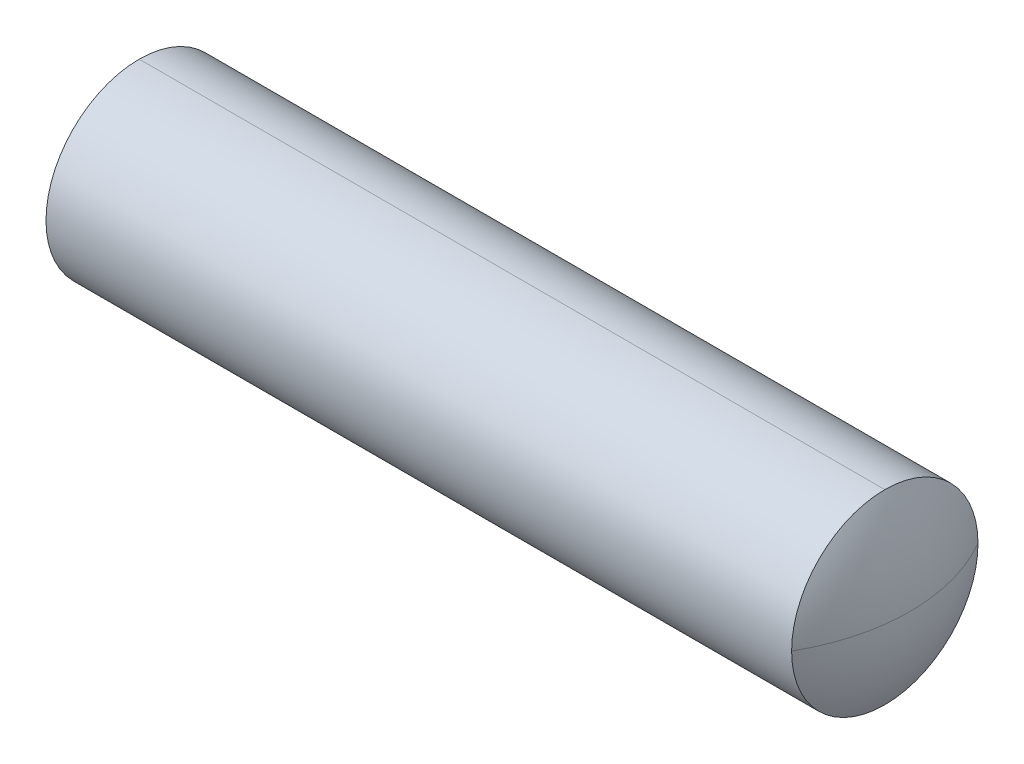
ISO-10303-21;
HEADER;
FILE_DESCRIPTION(('STEP AP214'),'2;1');
FILE_NAME('part.step','',(''),(''),'','','');
FILE_SCHEMA(('AUTOMOTIVE_DESIGN { 1 0 10303 214 1 1 1 1 }'));
ENDSEC;
DATA;
#1=APPLICATION_CONTEXT('core data for automotive mechanical design processes');
#2=APPLICATION_PROTOCOL_DEFINITION('international standard','automotive_design',2000,#1);
#3=PRODUCT_CONTEXT('',#1,'mechanical');
#4=PRODUCT('Part','Part','',(#3));
#5=PRODUCT_RELATED_PRODUCT_CATEGORY('part','',(#4));
#6=PRODUCT_DEFINITION_FORMATION('','',#4);
#7=PRODUCT_DEFINITION_CONTEXT('part definition',#1,'design');
#8=PRODUCT_DEFINITION('design','',#6,#7);
#9=PRODUCT_DEFINITION_SHAPE('','',#8);
#10=(LENGTH_UNIT() NAMED_UNIT(*) SI_UNIT(.MILLI.,.METRE.));
#11=(NAMED_UNIT(*) PLANE_ANGLE_UNIT() SI_UNIT($,.RADIAN.));
#12=(NAMED_UNIT(*) SI_UNIT($,.STERADIAN.) SOLID_ANGLE_UNIT());
#13=UNCERTAINTY_MEASURE_WITH_UNIT(LENGTH_MEASURE(1.E-05),#10,'distance_accuracy_value','');
#14=(GEOMETRIC_REPRESENTATION_CONTEXT(3) GLOBAL_UNCERTAINTY_ASSIGNED_CONTEXT((#13)) GLOBAL_UNIT_ASSIGNED_CONTEXT((#10,
#11,#12)) REPRESENTATION_CONTEXT('',''));
#15=CARTESIAN_POINT('',(0.,0.,0.));
#16=DIRECTION('',(0.,0.,1.));
#17=DIRECTION('',(1.,0.,0.));
#18=AXIS2_PLACEMENT_3D('',#15,#16,#17);
#19=CARTESIAN_POINT('',(4.330127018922,0.,0.));
#20=DIRECTION('',(0.,1.,0.));
#21=DIRECTION('',(1.,0.,0.));
#22=AXIS2_PLACEMENT_3D('',#19,#20,#21);
#23=SPHERICAL_SURFACE('',#22,5.);
#24=CARTESIAN_POINT('',(0.,0.,0.));
#25=DIRECTION('',(-1.,0.,0.));
#26=DIRECTION('',(0.,0.,1.));
#27=AXIS2_PLACEMENT_3D('',#24,#25,#26);
#28=CIRCLE('',#27,2.5);
#29=CARTESIAN_POINT('',(0.,0.,2.5));
#30=VERTEX_POINT('',#29);
#31=CARTESIAN_POINT('',(0.,2.5,0.));
#32=VERTEX_POINT('',#31);
#33=EDGE_CURVE('E102',#30,#32,#28,.T.);
#34=ORIENTED_EDGE('',*,*,#33,.T.);
#35=CARTESIAN_POINT('',(0.,0.,0.));
#36=DIRECTION('',(-1.,0.,0.));
#37=DIRECTION('',(0.,1.,0.));
#38=AXIS2_PLACEMENT_3D('',#35,#36,#37);
#39=CIRCLE('',#38,2.5);
#40=CARTESIAN_POINT('',(0.,0.,-2.5));
#41=VERTEX_POINT('',#40);
#42=EDGE_CURVE('E109',#32,#41,#39,.T.);
#43=ORIENTED_EDGE('',*,*,#42,.T.);
#44=CARTESIAN_POINT('',(4.330127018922,0.,0.));
#45=DIRECTION('',(0.,1.,0.));
#46=DIRECTION('',(-0.866025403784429,0.,-0.500000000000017));
#47=AXIS2_PLACEMENT_3D('',#44,#45,#46);
#48=CIRCLE('',#47,5.);
#49=EDGE_CURVE('E11',#41,#30,#48,.T.);
#50=ORIENTED_EDGE('',*,*,#49,.T.);
#51=EDGE_LOOP('',(#34,#43,#50));
#52=FACE_BOUND('',#51,.T.);
#53=ADVANCED_FACE('F17',(#52),#23,.T.);
#54=CARTESIAN_POINT('',(4.330127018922,0.,0.));
#55=DIRECTION('',(0.,1.,0.));
#56=DIRECTION('',(-0.500000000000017,0.,0.866025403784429));
#57=AXIS2_PLACEMENT_3D('',#54,#55,#56);
#58=SPHERICAL_SURFACE('',#57,5.);
#59=CARTESIAN_POINT('',(0.,0.,0.));
#60=DIRECTION('',(-1.,0.,0.));
#61=DIRECTION('',(0.,0.,-1.));
#62=AXIS2_PLACEMENT_3D('',#59,#60,#61);
#63=CIRCLE('',#62,2.5);
#64=CARTESIAN_POINT('',(0.,-2.5,0.));
#65=VERTEX_POINT('',#64);
#66=EDGE_CURVE('E105',#41,#65,#63,.T.);
#67=ORIENTED_EDGE('',*,*,#66,.T.);
#68=CARTESIAN_POINT('',(0.,0.,0.));
#69=DIRECTION('',(-1.,0.,0.));
#70=DIRECTION('',(0.,-1.,0.));
#71=AXIS2_PLACEMENT_3D('',#68,#69,#70);
#72=CIRCLE('',#71,2.5);
#73=EDGE_CURVE('E26',#65,#30,#72,.T.);
#74=ORIENTED_EDGE('',*,*,#73,.T.);
#75=ORIENTED_EDGE('',*,*,#49,.F.);
#76=EDGE_LOOP('',(#67,#74,#75));
#77=FACE_BOUND('',#76,.T.);
#78=ADVANCED_FACE('F121',(#77),#58,.T.);
#79=CARTESIAN_POINT('',(10.,0.,0.));
#80=DIRECTION('',(-1.,0.,0.));
#81=DIRECTION('',(0.,1.,0.));
#82=AXIS2_PLACEMENT_3D('',#79,#80,#81);
#83=CYLINDRICAL_SURFACE('',#82,2.5);
#84=ORIENTED_EDGE('',*,*,#33,.F.);
#85=ORIENTED_EDGE('',*,*,#73,.F.);
#86=DIRECTION('',(-1.,0.,0.));
#87=VECTOR('',#86,1.);
#88=CARTESIAN_POINT('',(20.,-2.5,0.));
#89=LINE('',#88,#87);
#90=CARTESIAN_POINT('',(20.,-2.5,0.));
#91=VERTEX_POINT('',#90);
#92=EDGE_CURVE('E77',#91,#65,#89,.T.);
#93=ORIENTED_EDGE('',*,*,#92,.F.);
#94=CARTESIAN_POINT('',(20.,0.,0.));
#95=DIRECTION('',(1.,0.,0.));
#96=DIRECTION('',(0.,0.,1.));
#97=AXIS2_PLACEMENT_3D('',#94,#95,#96);
#98=CIRCLE('',#97,2.5);
#99=CARTESIAN_POINT('',(20.,0.,2.5));
#100=VERTEX_POINT('',#99);
#101=EDGE_CURVE('E72',#100,#91,#98,.T.);
#102=ORIENTED_EDGE('',*,*,#101,.F.);
#103=CARTESIAN_POINT('',(20.,0.,0.));
#104=DIRECTION('',(1.,0.,0.));
#105=DIRECTION('',(0.,1.,0.));
#106=AXIS2_PLACEMENT_3D('',#103,#104,#105);
#107=CIRCLE('',#106,2.5);
#108=CARTESIAN_POINT('',(20.,2.5,0.));
#109=VERTEX_POINT('',#108);
#110=EDGE_CURVE('E84',#109,#100,#107,.T.);
#111=ORIENTED_EDGE('',*,*,#110,.F.);
#112=DIRECTION('',(1.,0.,0.));
#113=VECTOR('',#112,1.);
#114=CARTESIAN_POINT('',(0.,2.5,0.));
#115=LINE('',#114,#113);
#116=EDGE_CURVE('E90',#32,#109,#115,.T.);
#117=ORIENTED_EDGE('',*,*,#116,.F.);
#118=EDGE_LOOP('',(#84,#85,#93,#102,#111,#117));
#119=FACE_BOUND('',#118,.T.);
#120=ADVANCED_FACE('F119',(#119),#83,.T.);
#121=CARTESIAN_POINT('',(10.,0.,0.));
#122=DIRECTION('',(-1.,0.,0.));
#123=DIRECTION('',(0.,1.,0.));
#124=AXIS2_PLACEMENT_3D('',#121,#122,#123);
#125=CYLINDRICAL_SURFACE('',#124,2.5);
#126=CARTESIAN_POINT('',(20.,0.,0.));
#127=DIRECTION('',(1.,0.,0.));
#128=DIRECTION('',(0.,0.,-1.));
#129=AXIS2_PLACEMENT_3D('',#126,#127,#128);
#130=CIRCLE('',#129,2.5);
#131=CARTESIAN_POINT('',(20.,0.,-2.5));
#132=VERTEX_POINT('',#131);
#133=EDGE_CURVE('E82',#132,#109,#130,.T.);
#134=ORIENTED_EDGE('',*,*,#133,.F.);
#135=CARTESIAN_POINT('',(20.,0.,0.));
#136=DIRECTION('',(1.,0.,0.));
#137=DIRECTION('',(0.,-1.,0.));
#138=AXIS2_PLACEMENT_3D('',#135,#136,#137);
#139=CIRCLE('',#138,2.5);
#140=EDGE_CURVE('E67',#91,#132,#139,.T.);
#141=ORIENTED_EDGE('',*,*,#140,.F.);
#142=ORIENTED_EDGE('',*,*,#92,.T.);
#143=ORIENTED_EDGE('',*,*,#66,.F.);
#144=ORIENTED_EDGE('',*,*,#42,.F.);
#145=ORIENTED_EDGE('',*,*,#116,.T.);
#146=EDGE_LOOP('',(#134,#141,#142,#143,#144,#145));
#147=FACE_BOUND('',#146,.T.);
#148=ADVANCED_FACE('F87',(#147),#125,.T.);
#149=CARTESIAN_POINT('',(15.66987298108,0.,0.));
#150=DIRECTION('',(0.,1.,0.));
#151=DIRECTION('',(-0.500000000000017,0.,-0.866025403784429));
#152=AXIS2_PLACEMENT_3D('',#149,#150,#151);
#153=SPHERICAL_SURFACE('',#152,5.);
#154=ORIENTED_EDGE('',*,*,#101,.T.);
#155=ORIENTED_EDGE('',*,*,#140,.T.);
#156=CARTESIAN_POINT('',(15.66987298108,0.,0.));
#157=DIRECTION('',(0.,1.,0.));
#158=DIRECTION('',(0.866025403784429,0.,0.500000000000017));
#159=AXIS2_PLACEMENT_3D('',#156,#157,#158);
#160=CIRCLE('',#159,5.);
#161=EDGE_CURVE('E70',#100,#132,#160,.T.);
#162=ORIENTED_EDGE('',*,*,#161,.F.);
#163=EDGE_LOOP('',(#154,#155,#162));
#164=FACE_BOUND('',#163,.T.);
#165=ADVANCED_FACE('F69',(#164),#153,.T.);
#166=CARTESIAN_POINT('',(15.66987298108,0.,0.));
#167=DIRECTION('',(0.,1.,0.));
#168=DIRECTION('',(1.,0.,0.));
#169=AXIS2_PLACEMENT_3D('',#166,#167,#168);
#170=SPHERICAL_SURFACE('',#169,5.);
#171=ORIENTED_EDGE('',*,*,#133,.T.);
#172=ORIENTED_EDGE('',*,*,#110,.T.);
#173=ORIENTED_EDGE('',*,*,#161,.T.);
#174=EDGE_LOOP('',(#171,#172,#173));
#175=FACE_BOUND('',#174,.T.);
#176=ADVANCED_FACE('F81',(#175),#170,.T.);
#177=CLOSED_SHELL('',(#53,#78,#120,#148,#165,#176));
#178=MANIFOLD_SOLID_BREP('B1',#177);
#179=ADVANCED_BREP_SHAPE_REPRESENTATION('',(#18,#178),#14);
#180=SHAPE_DEFINITION_REPRESENTATION(#9,#179);
ENDSEC;
END-ISO-10303-21;
